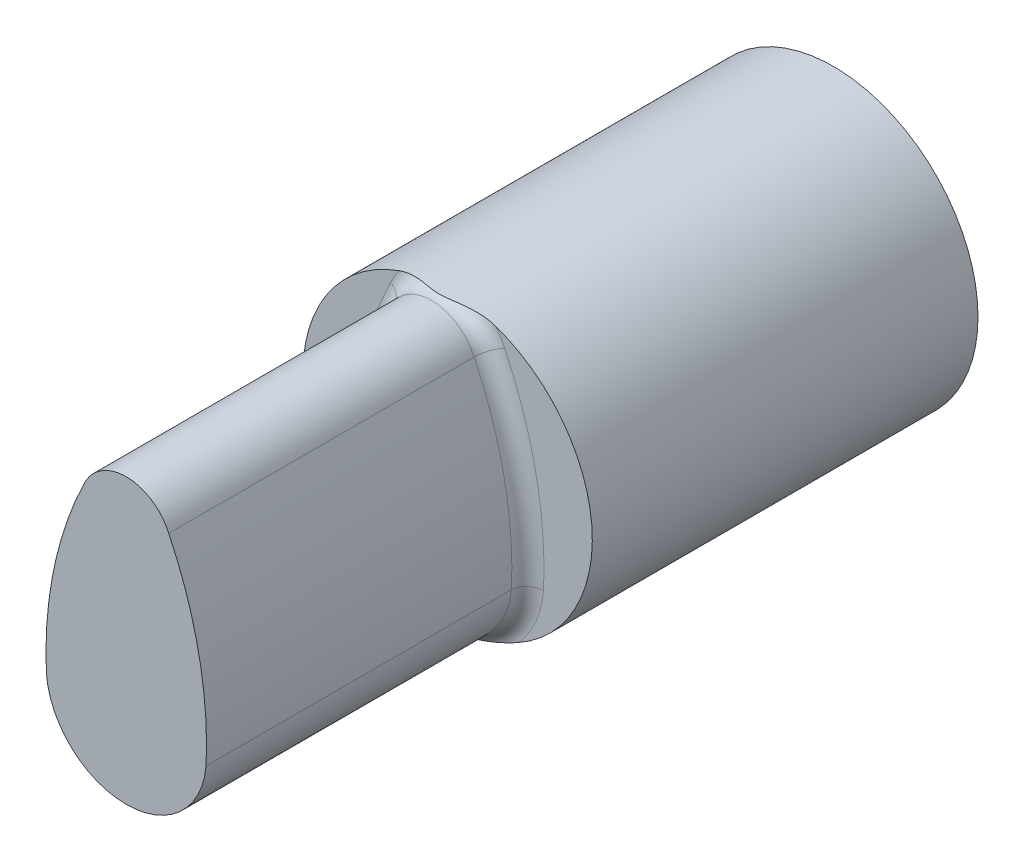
ISO-10303-21;
HEADER;
FILE_DESCRIPTION(('STEP AP214'),'2;1');
FILE_NAME('part.step','',(''),(''),'','','');
FILE_SCHEMA(('AUTOMOTIVE_DESIGN { 1 0 10303 214 1 1 1 1 }'));
ENDSEC;
DATA;
#1=APPLICATION_CONTEXT('core data for automotive mechanical design processes');
#2=APPLICATION_PROTOCOL_DEFINITION('international standard','automotive_design',2000,#1);
#3=PRODUCT_CONTEXT('',#1,'mechanical');
#4=PRODUCT('Part','Part','',(#3));
#5=PRODUCT_RELATED_PRODUCT_CATEGORY('part','',(#4));
#6=PRODUCT_DEFINITION_FORMATION('','',#4);
#7=PRODUCT_DEFINITION_CONTEXT('part definition',#1,'design');
#8=PRODUCT_DEFINITION('design','',#6,#7);
#9=PRODUCT_DEFINITION_SHAPE('','',#8);
#10=(LENGTH_UNIT() NAMED_UNIT(*) SI_UNIT(.MILLI.,.METRE.));
#11=(NAMED_UNIT(*) PLANE_ANGLE_UNIT() SI_UNIT($,.RADIAN.));
#12=(NAMED_UNIT(*) SI_UNIT($,.STERADIAN.) SOLID_ANGLE_UNIT());
#13=UNCERTAINTY_MEASURE_WITH_UNIT(LENGTH_MEASURE(1.E-05),#10,'distance_accuracy_value','');
#14=(GEOMETRIC_REPRESENTATION_CONTEXT(3) GLOBAL_UNCERTAINTY_ASSIGNED_CONTEXT((#13)) GLOBAL_UNIT_ASSIGNED_CONTEXT((#10,
#11,#12)) REPRESENTATION_CONTEXT('',''));
#15=CARTESIAN_POINT('',(0.,0.,0.));
#16=DIRECTION('',(0.,0.,1.));
#17=DIRECTION('',(1.,0.,0.));
#18=AXIS2_PLACEMENT_3D('',#15,#16,#17);
#19=CARTESIAN_POINT('',(0.,19.0453618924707,79.375));
#20=DIRECTION('',(0.,0.,1.));
#21=DIRECTION('',(1.,0.,0.));
#22=AXIS2_PLACEMENT_3D('',#19,#20,#21);
#23=TOROIDAL_SURFACE('',#22,12.337925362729,3.175);
#24=CARTESIAN_POINT('',(8.39523185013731,22.7167762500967,79.375));
#25=CARTESIAN_POINT('',(8.39522403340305,22.7167727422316,79.2857120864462));
#26=CARTESIAN_POINT('',(8.39865410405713,22.7183508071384,79.1964282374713));
#27=CARTESIAN_POINT('',(8.41232954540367,22.7246429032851,79.0184993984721));
#28=CARTESIAN_POINT('',(8.42257458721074,22.7293567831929,78.9298543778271));
#29=CARTESIAN_POINT('',(8.44981007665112,22.7418889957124,78.7538861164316));
#30=CARTESIAN_POINT('',(8.46679584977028,22.7497051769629,78.6665620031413));
#31=CARTESIAN_POINT('',(8.50737437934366,22.7683795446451,78.4938206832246));
#32=CARTESIAN_POINT('',(8.53096705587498,22.7792376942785,78.4084034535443));
#33=CARTESIAN_POINT('',(8.61146339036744,22.8162890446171,78.1558370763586));
#34=CARTESIAN_POINT('',(8.67809663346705,22.8469643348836,77.9923007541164));
#35=CARTESIAN_POINT('',(8.83529723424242,22.9193576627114,77.679993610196));
#36=CARTESIAN_POINT('',(8.92585889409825,22.9610730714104,77.5312192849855));
#37=CARTESIAN_POINT('',(9.12837338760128,23.0543942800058,77.2524866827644));
#38=CARTESIAN_POINT('',(9.2403269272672,23.1060004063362,77.1225290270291));
#39=CARTESIAN_POINT('',(9.48248055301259,23.2176718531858,76.8851107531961));
#40=CARTESIAN_POINT('',(9.61268700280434,23.2777401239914,76.7776580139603));
#41=CARTESIAN_POINT('',(9.88765428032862,23.4046477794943,76.5883057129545));
#42=CARTESIAN_POINT('',(10.0324217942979,23.4714902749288,76.5064179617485));
#43=CARTESIAN_POINT('',(10.3322953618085,23.6100104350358,76.3706447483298));
#44=CARTESIAN_POINT('',(10.4873914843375,23.6816834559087,76.316732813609));
#45=CARTESIAN_POINT('',(10.7399260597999,23.7984343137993,76.2540798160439));
#46=CARTESIAN_POINT('',(10.8355339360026,23.8426463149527,76.2358939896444));
#47=CARTESIAN_POINT('',(11.0278273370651,23.9315902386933,76.2102328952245));
#48=CARTESIAN_POINT('',(11.1245110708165,23.9763213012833,76.2027419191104));
#49=CARTESIAN_POINT('',(11.2402932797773,24.0299007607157,76.200207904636));
#50=CARTESIAN_POINT('',(11.2593544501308,24.0387219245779,76.1999994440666));
#51=CARTESIAN_POINT('',(11.2784127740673,24.0475421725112,76.2));
#52=B_SPLINE_CURVE_WITH_KNOTS('',3,(#24,#25,#26,#27,#28,#29,#30,#31,#32,#33,#34,#35,#36,#37,#38,
#39,#40,#41,#42,#43,#44,#45,#46,#47,#48,#49,#50,#51),.UNSPECIFIED.,.F.,.F.,(4,2,2,2,2,2,2,2,2,2,
2,2,2,4),(0.,0.267776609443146,0.535540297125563,0.80311862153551,1.07069370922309,
1.60562603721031,2.14043110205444,2.67525382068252,3.21026346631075,3.74551991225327,
4.28026893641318,4.60048995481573,4.92024016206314,4.98324854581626),.UNSPECIFIED.);
#53=CARTESIAN_POINT('',(11.2784127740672,24.0475421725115,76.2));
#54=VERTEX_POINT('',#53);
#55=CARTESIAN_POINT('',(8.39523185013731,22.7167762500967,79.375));
#56=VERTEX_POINT('',#55);
#57=EDGE_CURVE('E11',#54,#56,#52,.F.);
#58=ORIENTED_EDGE('',*,*,#57,.F.);
#59=CARTESIAN_POINT('',(0.,19.0453618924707,76.2));
#60=DIRECTION('',(0.,0.,1.));
#61=DIRECTION('',(1.,0.,0.));
#62=AXIS2_PLACEMENT_3D('',#59,#60,#61);
#63=CIRCLE('',#62,12.337925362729);
#64=CARTESIAN_POINT('',(9.46249430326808,26.9627859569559,76.2));
#65=VERTEX_POINT('',#64);
#66=EDGE_CURVE('E138',#65,#54,#63,.F.);
#67=ORIENTED_EDGE('',*,*,#66,.F.);
#68=CARTESIAN_POINT('',(-9.46249430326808,26.9627859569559,76.2));
#69=CARTESIAN_POINT('',(-9.27674546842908,27.0279775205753,76.2000120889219));
#70=CARTESIAN_POINT('',(-9.09037793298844,27.0912226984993,76.2047822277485));
#71=CARTESIAN_POINT('',(-8.71683803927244,27.2137085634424,76.2229405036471));
#72=CARTESIAN_POINT('',(-8.52966609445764,27.2729510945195,76.2363246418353));
#73=CARTESIAN_POINT('',(-7.96833191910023,27.4442902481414,76.2879674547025));
#74=CARTESIAN_POINT('',(-7.5933576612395,27.5503467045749,76.3377262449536));
#75=CARTESIAN_POINT('',(-6.8389306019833,27.7473167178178,76.4621119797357));
#76=CARTESIAN_POINT('',(-6.45947680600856,27.8380382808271,76.5370234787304));
#77=CARTESIAN_POINT('',(-5.89063911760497,27.9619147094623,76.6627973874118));
#78=CARTESIAN_POINT('',(-5.70103930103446,28.0011803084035,76.7069683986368));
#79=CARTESIAN_POINT('',(-5.32190964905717,28.075705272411,76.7988507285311));
#80=CARTESIAN_POINT('',(-5.13237981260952,28.1109646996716,76.8465619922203));
#81=CARTESIAN_POINT('',(-4.76892660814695,28.1747962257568,76.9404646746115));
#82=CARTESIAN_POINT('',(-4.59500576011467,28.203680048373,76.9864567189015));
#83=CARTESIAN_POINT('',(-4.2469862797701,28.258180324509,77.0796649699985));
#84=CARTESIAN_POINT('',(-4.07288765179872,28.2837968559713,77.126881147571));
#85=CARTESIAN_POINT('',(-3.72411554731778,28.3318303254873,77.2215380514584));
#86=CARTESIAN_POINT('',(-3.54944166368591,28.3542439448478,77.2689789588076));
#87=CARTESIAN_POINT('',(-3.19941502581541,28.3958700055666,77.3627656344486));
#88=CARTESIAN_POINT('',(-3.02406226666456,28.4150824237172,77.4091113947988));
#89=CARTESIAN_POINT('',(-2.67613051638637,28.4499359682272,77.4981651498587));
#90=CARTESIAN_POINT('',(-2.50357306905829,28.4656450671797,77.5409299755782));
#91=CARTESIAN_POINT('',(-2.15715554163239,28.4939907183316,77.6220795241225));
#92=CARTESIAN_POINT('',(-1.98329541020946,28.5066271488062,77.6604640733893));
#93=CARTESIAN_POINT('',(-1.63446347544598,28.5287506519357,77.7305611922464));
#94=CARTESIAN_POINT('',(-1.45949557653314,28.5382455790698,77.7622903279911));
#95=CARTESIAN_POINT('',(-1.10800339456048,28.5540520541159,77.8167652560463));
#96=CARTESIAN_POINT('',(-0.931479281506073,28.5603639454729,77.8395120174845));
#97=CARTESIAN_POINT('',(-0.570737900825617,28.5698897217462,77.8743912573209));
#98=CARTESIAN_POINT('',(-0.386475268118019,28.5729819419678,77.8861053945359));
#99=CARTESIAN_POINT('',(-0.0175667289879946,28.5755897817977,77.895958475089));
#100=CARTESIAN_POINT('',(0.167079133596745,28.5751057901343,77.8940988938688));
#101=CARTESIAN_POINT('',(0.535989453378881,28.5705694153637,77.8770447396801));
#102=CARTESIAN_POINT('',(0.720252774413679,28.566511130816,77.861828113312));
#103=CARTESIAN_POINT('',(1.08735353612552,28.5548951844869,77.8198986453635));
#104=CARTESIAN_POINT('',(1.27019059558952,28.5473366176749,77.7931828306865));
#105=CARTESIAN_POINT('',(1.6372144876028,28.5286610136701,77.7303896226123));
#106=CARTESIAN_POINT('',(1.82137181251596,28.5174859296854,77.6941614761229));
#107=CARTESIAN_POINT('',(2.18804463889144,28.4916982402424,77.6153679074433));
#108=CARTESIAN_POINT('',(2.37056019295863,28.4770857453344,77.5728026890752));
#109=CARTESIAN_POINT('',(2.73435936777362,28.4444593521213,77.4837213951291));
#110=CARTESIAN_POINT('',(2.91564261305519,28.4264444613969,77.4372041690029));
#111=CARTESIAN_POINT('',(3.27730356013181,28.3870215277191,77.342168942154));
#112=CARTESIAN_POINT('',(3.45768127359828,28.3656135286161,77.2936509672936));
#113=CARTESIAN_POINT('',(3.84960835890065,28.315309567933,77.1875814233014));
#114=CARTESIAN_POINT('',(4.06105068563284,28.2857588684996,77.1299442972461));
#115=CARTESIAN_POINT('',(4.48359289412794,28.221865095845,77.0160730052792));
#116=CARTESIAN_POINT('',(4.6946927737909,28.1875219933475,76.9598388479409));
#117=CARTESIAN_POINT('',(5.11681103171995,28.1139601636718,76.8504210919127));
#118=CARTESIAN_POINT('',(5.32782941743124,28.0747421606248,76.7972370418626));
#119=CARTESIAN_POINT('',(5.74995675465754,27.99133629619,76.6953174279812));
#120=CARTESIAN_POINT('',(5.96106570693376,27.9471483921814,76.6465819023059));
#121=CARTESIAN_POINT('',(6.58837869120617,27.8083715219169,76.5103145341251));
#122=CARTESIAN_POINT('',(7.00484562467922,27.7064780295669,76.4310183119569));
#123=CARTESIAN_POINT('',(7.83718088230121,27.4826218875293,76.3036546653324));
#124=CARTESIAN_POINT('',(8.25304941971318,27.3606723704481,76.2555669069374));
#125=CARTESIAN_POINT('',(8.86385679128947,27.1662548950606,76.2143301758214));
#126=CARTESIAN_POINT('',(9.06022052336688,27.1013993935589,76.2055937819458));
#127=CARTESIAN_POINT('',(9.45161377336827,26.9673946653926,76.1982909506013));
#128=CARTESIAN_POINT('',(9.64664376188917,26.8982470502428,76.1997207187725));
#129=CARTESIAN_POINT('',(10.0380582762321,26.7546654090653,76.2140094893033));
#130=CARTESIAN_POINT('',(10.2344112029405,26.680162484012,76.2270585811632));
#131=CARTESIAN_POINT('',(10.6244867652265,26.5272512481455,76.266277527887));
#132=CARTESIAN_POINT('',(10.8182064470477,26.4488389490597,76.2924610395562));
#133=CARTESIAN_POINT('',(11.0100601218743,26.368716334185,76.325915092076));
#134=B_SPLINE_CURVE_WITH_KNOTS('',3,(#68,#69,#70,#71,#72,#73,#74,#75,#76,#77,#78,#79,#80,#81,
#82,#83,#84,#85,#86,#87,#88,#89,#90,#91,#92,#93,#94,#95,#96,#97,#98,#99,#100,#101,#102,#103,
#104,#105,#106,#107,#108,#109,#110,#111,#112,#113,#114,#115,#116,#117,#118,#119,#120,#121,#122,
#123,#124,#125,#126,#127,#128,#129,#130,#131,#132,#133),.UNSPECIFIED.,.F.,.F.,(4,2,2,2,2,2,2,2,
2,2,2,2,2,2,2,2,2,2,2,2,2,2,2,2,2,2,2,2,2,2,2,2,4),(0.,0.590405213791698,1.18053654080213,
2.35765249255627,3.5485609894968,4.14429470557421,4.74001917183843,5.28659385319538,
5.83315549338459,6.38027940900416,6.92740729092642,7.46275781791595,7.99812954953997,
8.53215243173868,9.06611768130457,9.61959943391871,10.1730210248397,10.7273580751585,
11.2818385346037,11.8457010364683,12.4095454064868,12.9735544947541,13.5375562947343,
14.2009248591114,14.8642974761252,15.527571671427,16.1908515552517,17.4976650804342,
18.8036262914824,19.4243247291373,20.0447915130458,20.6755993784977,21.3070645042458),.UNSPECIFIED.);
#135=CARTESIAN_POINT('',(-9.46249430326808,26.9627859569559,76.2));
#136=VERTEX_POINT('',#135);
#137=EDGE_CURVE('E172',#136,#65,#134,.T.);
#138=ORIENTED_EDGE('',*,*,#137,.F.);
#139=CARTESIAN_POINT('',(0.,19.0453618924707,76.2));
#140=DIRECTION('',(0.,0.,1.));
#141=DIRECTION('',(1.,0.,0.));
#142=AXIS2_PLACEMENT_3D('',#139,#140,#141);
#143=CIRCLE('',#142,12.337925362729);
#144=CARTESIAN_POINT('',(-11.2784127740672,24.0475421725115,76.2));
#145=VERTEX_POINT('',#144);
#146=EDGE_CURVE('E147',#145,#136,#143,.F.);
#147=ORIENTED_EDGE('',*,*,#146,.F.);
#148=CARTESIAN_POINT('',(-8.39523185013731,22.7167762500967,79.375));
#149=CARTESIAN_POINT('',(-8.39522403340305,22.7167727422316,79.2857120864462));
#150=CARTESIAN_POINT('',(-8.39865410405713,22.7183508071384,79.1964282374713));
#151=CARTESIAN_POINT('',(-8.41232954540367,22.7246429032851,79.0184993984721));
#152=CARTESIAN_POINT('',(-8.42257458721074,22.7293567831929,78.9298543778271));
#153=CARTESIAN_POINT('',(-8.44981007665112,22.7418889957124,78.7538861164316));
#154=CARTESIAN_POINT('',(-8.46679584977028,22.7497051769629,78.6665620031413));
#155=CARTESIAN_POINT('',(-8.50737437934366,22.7683795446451,78.4938206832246));
#156=CARTESIAN_POINT('',(-8.53096705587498,22.7792376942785,78.4084034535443));
#157=CARTESIAN_POINT('',(-8.61146339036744,22.8162890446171,78.1558370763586));
#158=CARTESIAN_POINT('',(-8.67809663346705,22.8469643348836,77.9923007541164));
#159=CARTESIAN_POINT('',(-8.83529723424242,22.9193576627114,77.679993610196));
#160=CARTESIAN_POINT('',(-8.92585889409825,22.9610730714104,77.5312192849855));
#161=CARTESIAN_POINT('',(-9.12837338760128,23.0543942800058,77.2524866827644));
#162=CARTESIAN_POINT('',(-9.2403269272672,23.1060004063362,77.1225290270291));
#163=CARTESIAN_POINT('',(-9.48248055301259,23.2176718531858,76.8851107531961));
#164=CARTESIAN_POINT('',(-9.61268700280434,23.2777401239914,76.7776580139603));
#165=CARTESIAN_POINT('',(-9.88765428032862,23.4046477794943,76.5883057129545));
#166=CARTESIAN_POINT('',(-10.0324217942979,23.4714902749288,76.5064179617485));
#167=CARTESIAN_POINT('',(-10.3322953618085,23.6100104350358,76.3706447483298));
#168=CARTESIAN_POINT('',(-10.4873914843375,23.6816834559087,76.316732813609));
#169=CARTESIAN_POINT('',(-10.7399260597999,23.7984343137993,76.2540798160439));
#170=CARTESIAN_POINT('',(-10.8355339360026,23.8426463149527,76.2358939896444));
#171=CARTESIAN_POINT('',(-11.0278273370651,23.9315902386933,76.2102328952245));
#172=CARTESIAN_POINT('',(-11.1245110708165,23.9763213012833,76.2027419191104));
#173=CARTESIAN_POINT('',(-11.2402932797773,24.0299007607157,76.200207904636));
#174=CARTESIAN_POINT('',(-11.2593544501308,24.0387219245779,76.1999994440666));
#175=CARTESIAN_POINT('',(-11.2784127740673,24.0475421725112,76.2));
#176=B_SPLINE_CURVE_WITH_KNOTS('',3,(#148,#149,#150,#151,#152,#153,#154,#155,#156,#157,#158,
#159,#160,#161,#162,#163,#164,#165,#166,#167,#168,#169,#170,#171,#172,#173,#174,#175),
.UNSPECIFIED.,.F.,.F.,(4,2,2,2,2,2,2,2,2,2,2,2,2,4),(0.,0.267776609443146,0.535540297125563,
0.80311862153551,1.07069370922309,1.60562603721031,2.14043110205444,2.67525382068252,
3.21026346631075,3.74551991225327,4.28026893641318,4.60048995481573,4.92024016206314,
4.98324854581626),.UNSPECIFIED.);
#177=CARTESIAN_POINT('',(-8.39523185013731,22.7167762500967,79.375));
#178=VERTEX_POINT('',#177);
#179=EDGE_CURVE('E47',#145,#178,#176,.F.);
#180=ORIENTED_EDGE('',*,*,#179,.T.);
#181=CARTESIAN_POINT('',(0.,19.0453618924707,79.375));
#182=DIRECTION('',(0.,0.,1.));
#183=DIRECTION('',(1.,0.,0.));
#184=AXIS2_PLACEMENT_3D('',#181,#182,#183);
#185=CIRCLE('',#184,9.16292536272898);
#186=EDGE_CURVE('E125',#56,#178,#185,.T.);
#187=ORIENTED_EDGE('',*,*,#186,.F.);
#188=EDGE_LOOP('',(#58,#67,#138,#147,#180,#187));
#189=FACE_BOUND('',#188,.T.);
#190=ADVANCED_FACE('F34',(#189),#23,.F.);
#191=CARTESIAN_POINT('',(59.0339025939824,-9.86937391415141,79.375));
#192=DIRECTION('',(0.,0.,1.));
#193=DIRECTION('',(1.,0.,0.));
#194=AXIS2_PLACEMENT_3D('',#191,#192,#193);
#195=TOROIDAL_SURFACE('',#194,78.06522202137,3.175);
#196=ORIENTED_EDGE('',*,*,#179,.F.);
#197=CARTESIAN_POINT('',(59.0339025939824,-9.86937391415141,76.2));
#198=DIRECTION('',(0.,0.,1.));
#199=DIRECTION('',(1.,0.,0.));
#200=AXIS2_PLACEMENT_3D('',#197,#198,#199);
#201=CIRCLE('',#200,78.06522202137);
#202=CARTESIAN_POINT('',(-18.9415413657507,-13.6122375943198,76.2));
#203=VERTEX_POINT('',#202);
#204=EDGE_CURVE('E150',#203,#145,#201,.F.);
#205=ORIENTED_EDGE('',*,*,#204,.F.);
#206=CARTESIAN_POINT('',(-15.772973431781,-13.4016046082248,79.375));
#207=CARTESIAN_POINT('',(-15.7729648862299,-13.4016039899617,79.2857134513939));
#208=CARTESIAN_POINT('',(-15.7767320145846,-13.4018571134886,79.1964309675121));
#209=CARTESIAN_POINT('',(-15.7917514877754,-13.4028660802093,79.0185048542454));
#210=CARTESIAN_POINT('',(-15.8030034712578,-13.403621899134,78.9298611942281));
#211=CARTESIAN_POINT('',(-15.8329161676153,-13.4056307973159,78.7538957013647));
#212=CARTESIAN_POINT('',(-15.8515717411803,-13.4068835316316,78.6665729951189));
#213=CARTESIAN_POINT('',(-15.8961401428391,-13.4098754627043,78.4938344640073));
#214=CARTESIAN_POINT('',(-15.9220528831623,-13.4116146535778,78.4084186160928));
#215=CARTESIAN_POINT('',(-16.0104669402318,-13.4175466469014,78.1558563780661));
#216=CARTESIAN_POINT('',(-16.083656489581,-13.4224547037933,77.9923227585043));
#217=CARTESIAN_POINT('',(-16.2563355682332,-13.4340220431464,77.6800205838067));
#218=CARTESIAN_POINT('',(-16.3558188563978,-13.4406809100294,77.5312485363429));
#219=CARTESIAN_POINT('',(-16.5783011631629,-13.4555534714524,77.2525189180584));
#220=CARTESIAN_POINT('',(-16.7013011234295,-13.4637672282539,77.1225621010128));
#221=CARTESIAN_POINT('',(-16.967369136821,-13.4815092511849,76.8851451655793));
#222=CARTESIAN_POINT('',(-17.1104441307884,-13.4910379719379,76.7776928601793));
#223=CARTESIAN_POINT('',(-17.4126148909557,-13.5111315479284,76.5883385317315));
#224=CARTESIAN_POINT('',(-17.5717182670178,-13.5216968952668,76.5064487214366));
#225=CARTESIAN_POINT('',(-17.9013171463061,-13.5435497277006,76.3706695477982));
#226=CARTESIAN_POINT('',(-18.0718018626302,-13.5548365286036,76.3167540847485));
#227=CARTESIAN_POINT('',(-18.349959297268,-13.5732233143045,76.2539722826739));
#228=CARTESIAN_POINT('',(-18.455621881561,-13.5802015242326,76.2357167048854));
#229=CARTESIAN_POINT('',(-18.668148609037,-13.5942246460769,76.2100287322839));
#230=CARTESIAN_POINT('',(-18.7750107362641,-13.6012694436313,76.2025803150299));
#231=CARTESIAN_POINT('',(-18.9017895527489,-13.6096199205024,76.20018700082));
#232=CARTESIAN_POINT('',(-18.9216667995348,-13.6109289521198,76.1999995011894));
#233=CARTESIAN_POINT('',(-18.9415413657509,-13.612237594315,76.2));
#234=B_SPLINE_CURVE_WITH_KNOTS('',3,(#206,#207,#208,#209,#210,#211,#212,#213,#214,#215,#216,
#217,#218,#219,#220,#221,#222,#223,#224,#225,#226,#227,#228,#229,#230,#231,#232,#233),
.UNSPECIFIED.,.F.,.F.,(4,2,2,2,2,2,2,2,2,2,2,2,2,4),(0.,0.267772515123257,0.535532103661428,
0.803106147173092,1.07067695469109,1.60560057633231,2.14039734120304,2.67521552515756,
3.21021907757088,3.74547784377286,4.28023631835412,4.60213269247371,4.92355134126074,
4.98331079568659),.UNSPECIFIED.);
#235=CARTESIAN_POINT('',(-15.772973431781,-13.4016046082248,79.375));
#236=VERTEX_POINT('',#235);
#237=EDGE_CURVE('E61',#203,#236,#234,.F.);
#238=ORIENTED_EDGE('',*,*,#237,.T.);
#239=CARTESIAN_POINT('',(59.0339025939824,-9.86937391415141,79.375));
#240=DIRECTION('',(0.,0.,1.));
#241=DIRECTION('',(1.,0.,0.));
#242=AXIS2_PLACEMENT_3D('',#239,#240,#241);
#243=CIRCLE('',#242,74.89022202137);
#244=EDGE_CURVE('E162',#178,#236,#243,.T.);
#245=ORIENTED_EDGE('',*,*,#244,.F.);
#246=EDGE_LOOP('',(#196,#205,#238,#245));
#247=FACE_BOUND('',#246,.T.);
#248=ADVANCED_FACE('F36',(#247),#195,.F.);
#249=CARTESIAN_POINT('',(0.,-12.0262321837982,79.375));
#250=DIRECTION('',(0.,0.,1.));
#251=DIRECTION('',(1.,0.,0.));
#252=AXIS2_PLACEMENT_3D('',#249,#250,#251);
#253=TOROIDAL_SURFACE('',#252,19.0078247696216,3.175);
#254=ORIENTED_EDGE('',*,*,#237,.F.);
#255=CARTESIAN_POINT('',(0.,-12.0262321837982,76.2));
#256=DIRECTION('',(0.,0.,1.));
#257=DIRECTION('',(1.,0.,0.));
#258=AXIS2_PLACEMENT_3D('',#255,#256,#257);
#259=CIRCLE('',#258,19.0078247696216);
#260=CARTESIAN_POINT('',(-13.9476646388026,-24.9397930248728,76.2));
#261=VERTEX_POINT('',#260);
#262=EDGE_CURVE('E153',#261,#203,#259,.F.);
#263=ORIENTED_EDGE('',*,*,#262,.F.);
#264=CARTESIAN_POINT('',(13.9476646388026,-24.9397930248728,76.2));
#265=CARTESIAN_POINT('',(13.7145879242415,-25.0701436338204,76.2000087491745));
#266=CARTESIAN_POINT('',(13.4797117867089,-25.1972075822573,76.2032126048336));
#267=CARTESIAN_POINT('',(13.0066366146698,-25.4446313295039,76.2153648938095));
#268=CARTESIAN_POINT('',(12.768438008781,-25.564991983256,76.2243125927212));
#269=CARTESIAN_POINT('',(12.0496681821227,-25.9156344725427,76.2587812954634));
#270=CARTESIAN_POINT('',(11.5644495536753,-26.1357414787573,76.2919305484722));
#271=CARTESIAN_POINT('',(10.5807677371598,-26.5492835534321,76.3740259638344));
#272=CARTESIAN_POINT('',(10.0822428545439,-26.742551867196,76.4230650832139));
#273=CARTESIAN_POINT('',(9.07601388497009,-27.1005878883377,76.5320061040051));
#274=CARTESIAN_POINT('',(8.56830632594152,-27.2653445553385,76.5919121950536));
#275=CARTESIAN_POINT('',(7.68815762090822,-27.5239980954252,76.6996588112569));
#276=CARTESIAN_POINT('',(7.31757128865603,-27.6248295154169,76.7461918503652));
#277=CARTESIAN_POINT('',(6.57266738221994,-27.811474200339,76.8397969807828));
#278=CARTESIAN_POINT('',(6.19834957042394,-27.8972865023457,76.8868691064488));
#279=CARTESIAN_POINT('',(5.44621666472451,-28.0538223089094,76.9789897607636));
#280=CARTESIAN_POINT('',(5.06840065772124,-28.1245417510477,77.024037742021));
#281=CARTESIAN_POINT('',(4.3096740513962,-28.2507561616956,77.1092167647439));
#282=CARTESIAN_POINT('',(3.92876348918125,-28.3062513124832,77.1493478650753));
#283=CARTESIAN_POINT('',(3.16604755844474,-28.4016507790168,77.2214503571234));
#284=CARTESIAN_POINT('',(2.7842548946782,-28.4416274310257,77.2534593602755));
#285=CARTESIAN_POINT('',(2.01860888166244,-28.5061995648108,77.3066563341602));
#286=CARTESIAN_POINT('',(1.63475561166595,-28.5307956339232,77.3278447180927));
#287=CARTESIAN_POINT('',(0.866140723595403,-28.5644582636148,77.3571617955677));
#288=CARTESIAN_POINT('',(0.481380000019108,-28.5735364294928,77.3653002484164));
#289=CARTESIAN_POINT('',(-0.288233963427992,-28.5761371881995,77.367612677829));
#290=CARTESIAN_POINT('',(-0.673087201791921,-28.5696600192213,77.3617868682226));
#291=CARTESIAN_POINT('',(-1.41813569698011,-28.5420712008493,77.3376179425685));
#292=CARTESIAN_POINT('',(-1.7783923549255,-28.521883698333,77.3200663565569));
#293=CARTESIAN_POINT('',(-2.49724870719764,-28.4679521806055,77.274933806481));
#294=CARTESIAN_POINT('',(-2.8558483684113,-28.4342078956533,77.247352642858));
#295=CARTESIAN_POINT('',(-3.57110222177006,-28.3532626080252,77.1844336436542));
#296=CARTESIAN_POINT('',(-3.92775471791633,-28.3060513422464,77.1490898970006));
#297=CARTESIAN_POINT('',(-4.6384680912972,-28.1983053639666,77.0731666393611));
#298=CARTESIAN_POINT('',(-4.99252896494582,-28.1377706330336,77.032587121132));
#299=CARTESIAN_POINT('',(-5.69929970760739,-28.003188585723,76.9484381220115));
#300=CARTESIAN_POINT('',(-6.05199732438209,-27.9290845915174,76.9048565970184));
#301=CARTESIAN_POINT('',(-6.75426812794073,-27.7676124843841,76.8171014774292));
#302=CARTESIAN_POINT('',(-7.10384130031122,-27.6802443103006,76.7729278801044));
#303=CARTESIAN_POINT('',(-7.7994855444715,-27.4923335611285,76.6860083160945));
#304=CARTESIAN_POINT('',(-8.14555776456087,-27.3917954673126,76.6432618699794));
#305=CARTESIAN_POINT('',(-8.83397786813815,-27.1775903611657,76.5609768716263));
#306=CARTESIAN_POINT('',(-9.17632588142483,-27.0639238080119,76.5214382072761));
#307=CARTESIAN_POINT('',(-10.0755985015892,-26.7462947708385,76.4233691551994));
#308=CARTESIAN_POINT('',(-10.6291053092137,-26.5312294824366,76.3689527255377));
#309=CARTESIAN_POINT('',(-11.7228648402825,-26.0664123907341,76.2799629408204));
#310=CARTESIAN_POINT('',(-12.2631226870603,-25.8166742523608,76.2453817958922));
#311=CARTESIAN_POINT('',(-13.0616207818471,-25.4167938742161,76.2134001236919));
#312=CARTESIAN_POINT('',(-13.3258477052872,-25.2792636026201,76.2060550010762));
#313=CARTESIAN_POINT('',(-13.8499479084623,-24.9959652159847,76.1989136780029));
#314=CARTESIAN_POINT('',(-14.1098215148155,-24.8501977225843,76.1991169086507));
#315=CARTESIAN_POINT('',(-14.6251520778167,-24.5504479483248,76.2080603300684));
#316=CARTESIAN_POINT('',(-14.8806021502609,-24.3964541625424,76.2168127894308));
#317=CARTESIAN_POINT('',(-15.3862526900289,-24.0807569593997,76.2440626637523));
#318=CARTESIAN_POINT('',(-15.6364516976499,-23.9190514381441,76.2625627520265));
#319=CARTESIAN_POINT('',(-15.8837302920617,-23.7536889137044,76.2865296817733));
#320=B_SPLINE_CURVE_WITH_KNOTS('',3,(#264,#265,#266,#267,#268,#269,#270,#271,#272,#273,#274,
#275,#276,#277,#278,#279,#280,#281,#282,#283,#284,#285,#286,#287,#288,#289,#290,#291,#292,#293,
#294,#295,#296,#297,#298,#299,#300,#301,#302,#303,#304,#305,#306,#307,#308,#309,#310,#311,#312,
#313,#314,#315,#316,#317,#318,#319),.UNSPECIFIED.,.F.,.F.,(4,2,2,2,2,2,2,2,2,2,2,2,2,2,2,2,2,2,
2,2,2,2,2,2,2,2,2,4),(0.,0.80104790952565,1.60199341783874,3.20226088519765,4.81206438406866,
6.42248984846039,7.58280643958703,8.74319739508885,9.90390029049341,11.0645892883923,
12.2198010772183,13.3749687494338,14.5292721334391,15.6835578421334,16.7668828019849,
17.850229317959,18.9344036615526,20.0185795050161,21.1073916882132,22.1962088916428,
23.2846565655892,24.3730661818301,26.1605850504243,27.9474014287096,28.8411026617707,
29.7347365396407,30.6296547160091,31.5248184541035),.UNSPECIFIED.);
#321=CARTESIAN_POINT('',(13.9476646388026,-24.9397930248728,76.2));
#322=VERTEX_POINT('',#321);
#323=EDGE_CURVE('E165',#322,#261,#320,.T.);
#324=ORIENTED_EDGE('',*,*,#323,.F.);
#325=CARTESIAN_POINT('',(0.,-12.0262321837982,76.2));
#326=DIRECTION('',(0.,0.,1.));
#327=DIRECTION('',(1.,0.,0.));
#328=AXIS2_PLACEMENT_3D('',#325,#326,#327);
#329=CIRCLE('',#328,19.0078247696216);
#330=CARTESIAN_POINT('',(18.9415413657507,-13.6122375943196,76.2));
#331=VERTEX_POINT('',#330);
#332=EDGE_CURVE('E144',#331,#322,#329,.F.);
#333=ORIENTED_EDGE('',*,*,#332,.F.);
#334=CARTESIAN_POINT('',(15.772973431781,-13.4016046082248,79.375));
#335=CARTESIAN_POINT('',(15.77296488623,-13.4016039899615,79.2857134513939));
#336=CARTESIAN_POINT('',(15.7767320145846,-13.4018571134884,79.1964309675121));
#337=CARTESIAN_POINT('',(15.7917514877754,-13.4028660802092,79.0185048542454));
#338=CARTESIAN_POINT('',(15.8030034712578,-13.403621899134,78.9298611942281));
#339=CARTESIAN_POINT('',(15.8329161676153,-13.4056307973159,78.7538957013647));
#340=CARTESIAN_POINT('',(15.8515717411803,-13.4068835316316,78.6665729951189));
#341=CARTESIAN_POINT('',(15.8961401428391,-13.4098754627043,78.4938344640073));
#342=CARTESIAN_POINT('',(15.9220528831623,-13.4116146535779,78.4084186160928));
#343=CARTESIAN_POINT('',(16.0104669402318,-13.4175466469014,78.1558563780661));
#344=CARTESIAN_POINT('',(16.083656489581,-13.4224547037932,77.9923227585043));
#345=CARTESIAN_POINT('',(16.2563355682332,-13.4340220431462,77.6800205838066));
#346=CARTESIAN_POINT('',(16.3558188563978,-13.4406809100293,77.5312485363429));
#347=CARTESIAN_POINT('',(16.5783011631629,-13.4555534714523,77.2525189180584));
#348=CARTESIAN_POINT('',(16.7013011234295,-13.4637672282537,77.1225621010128));
#349=CARTESIAN_POINT('',(16.967369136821,-13.4815092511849,76.8851451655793));
#350=CARTESIAN_POINT('',(17.1104441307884,-13.4910379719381,76.7776928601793));
#351=CARTESIAN_POINT('',(17.4126148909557,-13.5111315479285,76.5883385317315));
#352=CARTESIAN_POINT('',(17.5717182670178,-13.5216968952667,76.5064487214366));
#353=CARTESIAN_POINT('',(17.9013171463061,-13.5435497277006,76.3706695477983));
#354=CARTESIAN_POINT('',(18.0718018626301,-13.5548365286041,76.3167540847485));
#355=CARTESIAN_POINT('',(18.349959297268,-13.5732233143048,76.2539722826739));
#356=CARTESIAN_POINT('',(18.455621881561,-13.5802015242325,76.2357167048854));
#357=CARTESIAN_POINT('',(18.668148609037,-13.5942246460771,76.2100287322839));
#358=CARTESIAN_POINT('',(18.775010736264,-13.6012694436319,76.2025803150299));
#359=CARTESIAN_POINT('',(18.9017895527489,-13.6096199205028,76.20018700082));
#360=CARTESIAN_POINT('',(18.9216667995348,-13.6109289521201,76.1999995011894));
#361=CARTESIAN_POINT('',(18.9415413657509,-13.6122375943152,76.2));
#362=B_SPLINE_CURVE_WITH_KNOTS('',3,(#334,#335,#336,#337,#338,#339,#340,#341,#342,#343,#344,
#345,#346,#347,#348,#349,#350,#351,#352,#353,#354,#355,#356,#357,#358,#359,#360,#361),
.UNSPECIFIED.,.F.,.F.,(4,2,2,2,2,2,2,2,2,2,2,2,2,4),(0.,0.267772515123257,0.535532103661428,
0.803106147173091,1.07067695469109,1.6056005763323,2.14039734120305,2.67521552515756,
3.21021907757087,3.74547784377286,4.28023631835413,4.6021326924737,4.92355134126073,
4.98331079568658),.UNSPECIFIED.);
#363=CARTESIAN_POINT('',(15.772973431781,-13.4016046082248,79.375));
#364=VERTEX_POINT('',#363);
#365=EDGE_CURVE('E189',#331,#364,#362,.F.);
#366=ORIENTED_EDGE('',*,*,#365,.T.);
#367=CARTESIAN_POINT('',(0.,-12.0262321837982,79.375));
#368=DIRECTION('',(0.,0.,1.));
#369=DIRECTION('',(1.,0.,0.));
#370=AXIS2_PLACEMENT_3D('',#367,#368,#369);
#371=CIRCLE('',#370,15.8328247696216);
#372=EDGE_CURVE('E159',#236,#364,#371,.T.);
#373=ORIENTED_EDGE('',*,*,#372,.F.);
#374=EDGE_LOOP('',(#254,#263,#324,#333,#366,#373));
#375=FACE_BOUND('',#374,.T.);
#376=ADVANCED_FACE('F180',(#375),#253,.F.);
#377=CARTESIAN_POINT('',(-59.0339025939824,-9.86937391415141,79.375));
#378=DIRECTION('',(0.,0.,1.));
#379=DIRECTION('',(1.,0.,0.));
#380=AXIS2_PLACEMENT_3D('',#377,#378,#379);
#381=TOROIDAL_SURFACE('',#380,78.06522202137,3.175);
#382=CARTESIAN_POINT('',(-59.0339025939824,-9.86937391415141,76.2));
#383=DIRECTION('',(0.,0.,1.));
#384=DIRECTION('',(1.,0.,0.));
#385=AXIS2_PLACEMENT_3D('',#382,#383,#384);
#386=CIRCLE('',#385,78.06522202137);
#387=EDGE_CURVE('E141',#54,#331,#386,.F.);
#388=ORIENTED_EDGE('',*,*,#387,.F.);
#389=ORIENTED_EDGE('',*,*,#57,.T.);
#390=CARTESIAN_POINT('',(-59.0339025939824,-9.86937391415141,79.375));
#391=DIRECTION('',(0.,0.,1.));
#392=DIRECTION('',(1.,0.,0.));
#393=AXIS2_PLACEMENT_3D('',#390,#391,#392);
#394=CIRCLE('',#393,74.89022202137);
#395=EDGE_CURVE('E156',#364,#56,#394,.T.);
#396=ORIENTED_EDGE('',*,*,#395,.F.);
#397=ORIENTED_EDGE('',*,*,#365,.F.);
#398=EDGE_LOOP('',(#388,#389,#396,#397));
#399=FACE_BOUND('',#398,.T.);
#400=ADVANCED_FACE('F183',(#399),#381,.F.);
#401=CARTESIAN_POINT('',(0.,0.,76.2));
#402=DIRECTION('',(0.,0.,1.));
#403=DIRECTION('',(1.,0.,0.));
#404=AXIS2_PLACEMENT_3D('',#401,#402,#403);
#405=PLANE('',#404);
#406=CARTESIAN_POINT('',(0.,0.,76.2));
#407=DIRECTION('',(0.,0.,1.));
#408=DIRECTION('',(1.,0.,0.));
#409=AXIS2_PLACEMENT_3D('',#406,#407,#408);
#410=CIRCLE('',#409,28.575);
#411=EDGE_CURVE('E136',#136,#261,#410,.T.);
#412=ORIENTED_EDGE('',*,*,#411,.T.);
#413=ORIENTED_EDGE('',*,*,#262,.T.);
#414=ORIENTED_EDGE('',*,*,#204,.T.);
#415=ORIENTED_EDGE('',*,*,#146,.T.);
#416=EDGE_LOOP('',(#412,#413,#414,#415));
#417=FACE_BOUND('',#416,.T.);
#418=ADVANCED_FACE('F198',(#417),#405,.T.);
#419=ORIENTED_EDGE('',*,*,#387,.T.);
#420=ORIENTED_EDGE('',*,*,#332,.T.);
#421=EDGE_CURVE('E129',#322,#65,#410,.T.);
#422=ORIENTED_EDGE('',*,*,#421,.T.);
#423=ORIENTED_EDGE('',*,*,#66,.T.);
#424=EDGE_LOOP('',(#419,#420,#422,#423));
#425=FACE_BOUND('',#424,.T.);
#426=ADVANCED_FACE('F204',(#425),#405,.T.);
#427=CARTESIAN_POINT('',(0.,0.,76.2));
#428=DIRECTION('',(0.,0.,-1.));
#429=DIRECTION('',(-1.,0.,0.));
#430=AXIS2_PLACEMENT_3D('',#427,#428,#429);
#431=CYLINDRICAL_SURFACE('',#430,28.575);
#432=ORIENTED_EDGE('',*,*,#411,.F.);
#433=ORIENTED_EDGE('',*,*,#137,.T.);
#434=ORIENTED_EDGE('',*,*,#421,.F.);
#435=ORIENTED_EDGE('',*,*,#323,.T.);
#436=EDGE_LOOP('',(#432,#433,#434,#435));
#437=FACE_BOUND('',#436,.T.);
#438=CARTESIAN_POINT('',(0.,0.,0.));
#439=DIRECTION('',(0.,0.,1.));
#440=DIRECTION('',(1.,0.,0.));
#441=AXIS2_PLACEMENT_3D('',#438,#439,#440);
#442=CIRCLE('',#441,28.575);
#443=CARTESIAN_POINT('',(28.575,0.,0.));
#444=VERTEX_POINT('',#443);
#445=EDGE_CURVE('E126',#444,#444,#442,.T.);
#446=ORIENTED_EDGE('',*,*,#445,.T.);
#447=EDGE_LOOP('',(#446));
#448=FACE_BOUND('',#447,.T.);
#449=ADVANCED_FACE('F177',(#437,#448),#431,.T.);
#450=CARTESIAN_POINT('',(0.,0.,0.));
#451=DIRECTION('',(0.,0.,1.));
#452=DIRECTION('',(1.,0.,0.));
#453=AXIS2_PLACEMENT_3D('',#450,#451,#452);
#454=PLANE('',#453);
#455=ORIENTED_EDGE('',*,*,#445,.F.);
#456=EDGE_LOOP('',(#455));
#457=FACE_BOUND('',#456,.T.);
#458=ADVANCED_FACE('F248',(#457),#454,.F.);
#459=CARTESIAN_POINT('',(0.,19.0453618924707,139.7));
#460=DIRECTION('',(0.,0.,-1.));
#461=DIRECTION('',(-1.,0.,0.));
#462=AXIS2_PLACEMENT_3D('',#459,#460,#461);
#463=CYLINDRICAL_SURFACE('',#462,9.16292536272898);
#464=DIRECTION('',(0.,0.,-1.));
#465=VECTOR('',#464,1.);
#466=CARTESIAN_POINT('',(8.39523185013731,22.7167762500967,139.7));
#467=LINE('',#466,#465);
#468=CARTESIAN_POINT('',(8.39523185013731,22.7167762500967,139.7));
#469=VERTEX_POINT('',#468);
#470=EDGE_CURVE('E231',#469,#56,#467,.T.);
#471=ORIENTED_EDGE('',*,*,#470,.T.);
#472=ORIENTED_EDGE('',*,*,#186,.T.);
#473=DIRECTION('',(0.,0.,-1.));
#474=VECTOR('',#473,1.);
#475=CARTESIAN_POINT('',(-8.39523185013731,22.7167762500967,139.7));
#476=LINE('',#475,#474);
#477=CARTESIAN_POINT('',(-8.39523185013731,22.7167762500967,139.7));
#478=VERTEX_POINT('',#477);
#479=EDGE_CURVE('E108',#478,#178,#476,.T.);
#480=ORIENTED_EDGE('',*,*,#479,.F.);
#481=CARTESIAN_POINT('',(0.,19.0453618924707,139.7));
#482=DIRECTION('',(0.,0.,1.));
#483=DIRECTION('',(1.,0.,0.));
#484=AXIS2_PLACEMENT_3D('',#481,#482,#483);
#485=CIRCLE('',#484,9.16292536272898);
#486=EDGE_CURVE('E114',#469,#478,#485,.T.);
#487=ORIENTED_EDGE('',*,*,#486,.F.);
#488=EDGE_LOOP('',(#471,#472,#480,#487));
#489=FACE_BOUND('',#488,.T.);
#490=ADVANCED_FACE('F124',(#489),#463,.T.);
#491=CARTESIAN_POINT('',(59.0339025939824,-9.86937391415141,139.7));
#492=DIRECTION('',(0.,0.,-1.));
#493=DIRECTION('',(-1.,0.,0.));
#494=AXIS2_PLACEMENT_3D('',#491,#492,#493);
#495=CYLINDRICAL_SURFACE('',#494,74.89022202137);
#496=ORIENTED_EDGE('',*,*,#479,.T.);
#497=ORIENTED_EDGE('',*,*,#244,.T.);
#498=DIRECTION('',(0.,0.,-1.));
#499=VECTOR('',#498,1.);
#500=CARTESIAN_POINT('',(-15.772973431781,-13.4016046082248,139.7));
#501=LINE('',#500,#499);
#502=CARTESIAN_POINT('',(-15.772973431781,-13.4016046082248,139.7));
#503=VERTEX_POINT('',#502);
#504=EDGE_CURVE('E110',#503,#236,#501,.T.);
#505=ORIENTED_EDGE('',*,*,#504,.F.);
#506=CARTESIAN_POINT('',(59.0339025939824,-9.86937391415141,139.7));
#507=DIRECTION('',(0.,0.,1.));
#508=DIRECTION('',(1.,0.,0.));
#509=AXIS2_PLACEMENT_3D('',#506,#507,#508);
#510=CIRCLE('',#509,74.89022202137);
#511=EDGE_CURVE('E104',#478,#503,#510,.T.);
#512=ORIENTED_EDGE('',*,*,#511,.F.);
#513=EDGE_LOOP('',(#496,#497,#505,#512));
#514=FACE_BOUND('',#513,.T.);
#515=ADVANCED_FACE('F106',(#514),#495,.T.);
#516=CARTESIAN_POINT('',(0.,-12.0262321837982,139.7));
#517=DIRECTION('',(0.,0.,-1.));
#518=DIRECTION('',(-1.,0.,0.));
#519=AXIS2_PLACEMENT_3D('',#516,#517,#518);
#520=CYLINDRICAL_SURFACE('',#519,15.8328247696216);
#521=ORIENTED_EDGE('',*,*,#504,.T.);
#522=ORIENTED_EDGE('',*,*,#372,.T.);
#523=DIRECTION('',(0.,0.,-1.));
#524=VECTOR('',#523,1.);
#525=CARTESIAN_POINT('',(15.772973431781,-13.4016046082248,139.7));
#526=LINE('',#525,#524);
#527=CARTESIAN_POINT('',(15.772973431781,-13.4016046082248,139.7));
#528=VERTEX_POINT('',#527);
#529=EDGE_CURVE('E131',#528,#364,#526,.T.);
#530=ORIENTED_EDGE('',*,*,#529,.F.);
#531=CARTESIAN_POINT('',(0.,-12.0262321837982,139.7));
#532=DIRECTION('',(0.,0.,1.));
#533=DIRECTION('',(1.,0.,0.));
#534=AXIS2_PLACEMENT_3D('',#531,#532,#533);
#535=CIRCLE('',#534,15.8328247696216);
#536=EDGE_CURVE('E113',#503,#528,#535,.T.);
#537=ORIENTED_EDGE('',*,*,#536,.F.);
#538=EDGE_LOOP('',(#521,#522,#530,#537));
#539=FACE_BOUND('',#538,.T.);
#540=ADVANCED_FACE('F228',(#539),#520,.T.);
#541=CARTESIAN_POINT('',(-59.0339025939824,-9.86937391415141,139.7));
#542=DIRECTION('',(0.,0.,-1.));
#543=DIRECTION('',(-1.,0.,0.));
#544=AXIS2_PLACEMENT_3D('',#541,#542,#543);
#545=CYLINDRICAL_SURFACE('',#544,74.89022202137);
#546=ORIENTED_EDGE('',*,*,#529,.T.);
#547=ORIENTED_EDGE('',*,*,#395,.T.);
#548=ORIENTED_EDGE('',*,*,#470,.F.);
#549=CARTESIAN_POINT('',(-59.0339025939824,-9.86937391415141,139.7));
#550=DIRECTION('',(0.,0.,1.));
#551=DIRECTION('',(1.,0.,0.));
#552=AXIS2_PLACEMENT_3D('',#549,#550,#551);
#553=CIRCLE('',#552,74.89022202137);
#554=EDGE_CURVE('E120',#469,#528,#553,.F.);
#555=ORIENTED_EDGE('',*,*,#554,.T.);
#556=EDGE_LOOP('',(#546,#547,#548,#555));
#557=FACE_BOUND('',#556,.T.);
#558=ADVANCED_FACE('F235',(#557),#545,.T.);
#559=CARTESIAN_POINT('',(0.,0.,139.7));
#560=DIRECTION('',(0.,0.,1.));
#561=DIRECTION('',(1.,0.,0.));
#562=AXIS2_PLACEMENT_3D('',#559,#560,#561);
#563=PLANE('',#562);
#564=ORIENTED_EDGE('',*,*,#486,.T.);
#565=ORIENTED_EDGE('',*,*,#511,.T.);
#566=ORIENTED_EDGE('',*,*,#536,.T.);
#567=ORIENTED_EDGE('',*,*,#554,.F.);
#568=EDGE_LOOP('',(#564,#565,#566,#567));
#569=FACE_BOUND('',#568,.T.);
#570=ADVANCED_FACE('F118',(#569),#563,.T.);
#571=CLOSED_SHELL('',(#190,#248,#376,#400,#418,#426,#449,#458,#490,#515,#540,#558,#570));
#572=MANIFOLD_SOLID_BREP('B2',#571);
#573=ADVANCED_BREP_SHAPE_REPRESENTATION('',(#18,#572),#14);
#574=SHAPE_DEFINITION_REPRESENTATION(#9,#573);
ENDSEC;
END-ISO-10303-21;
